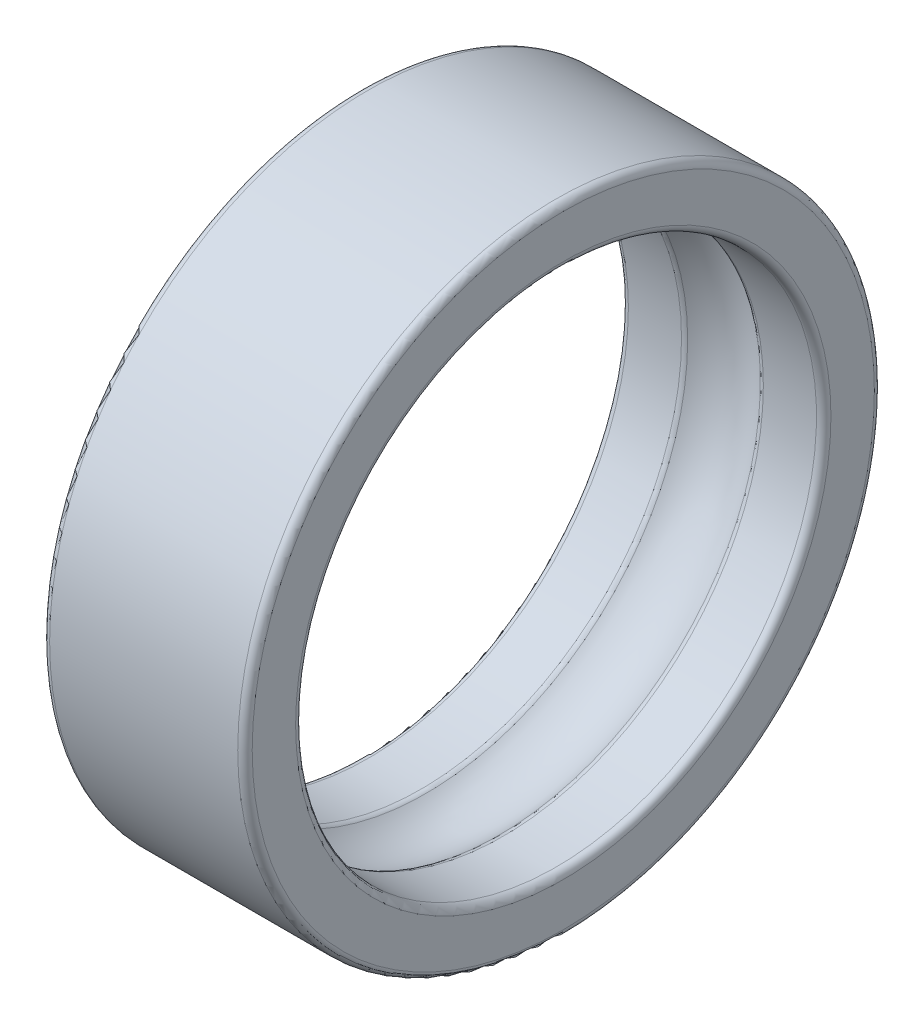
ISO-10303-21;
HEADER;
FILE_DESCRIPTION(('STEP AP214'),'2;1');
FILE_NAME('part.step','',(''),(''),'','','');
FILE_SCHEMA(('AUTOMOTIVE_DESIGN { 1 0 10303 214 1 1 1 1 }'));
ENDSEC;
DATA;
#1=APPLICATION_CONTEXT('core data for automotive mechanical design processes');
#2=APPLICATION_PROTOCOL_DEFINITION('international standard','automotive_design',2000,#1);
#3=PRODUCT_CONTEXT('',#1,'mechanical');
#4=PRODUCT('Part','Part','',(#3));
#5=PRODUCT_RELATED_PRODUCT_CATEGORY('part','',(#4));
#6=PRODUCT_DEFINITION_FORMATION('','',#4);
#7=PRODUCT_DEFINITION_CONTEXT('part definition',#1,'design');
#8=PRODUCT_DEFINITION('design','',#6,#7);
#9=PRODUCT_DEFINITION_SHAPE('','',#8);
#10=(LENGTH_UNIT() NAMED_UNIT(*) SI_UNIT(.MILLI.,.METRE.));
#11=(NAMED_UNIT(*) PLANE_ANGLE_UNIT() SI_UNIT($,.RADIAN.));
#12=(NAMED_UNIT(*) SI_UNIT($,.STERADIAN.) SOLID_ANGLE_UNIT());
#13=UNCERTAINTY_MEASURE_WITH_UNIT(LENGTH_MEASURE(1.E-05),#10,'distance_accuracy_value','');
#14=(GEOMETRIC_REPRESENTATION_CONTEXT(3) GLOBAL_UNCERTAINTY_ASSIGNED_CONTEXT((#13)) GLOBAL_UNIT_ASSIGNED_CONTEXT((#10,
#11,#12)) REPRESENTATION_CONTEXT('',''));
#15=CARTESIAN_POINT('',(0.,0.,0.));
#16=DIRECTION('',(0.,0.,1.));
#17=DIRECTION('',(1.,0.,0.));
#18=AXIS2_PLACEMENT_3D('',#15,#16,#17);
#19=CARTESIAN_POINT('',(-3.5,9.,0.));
#20=DIRECTION('',(1.,0.,0.));
#21=DIRECTION('',(0.,0.,-1.));
#22=AXIS2_PLACEMENT_3D('',#19,#20,#21);
#23=PLANE('',#22);
#24=CARTESIAN_POINT('',(-3.5,0.,0.));
#25=DIRECTION('',(1.,0.,0.));
#26=DIRECTION('',(0.,0.,-1.));
#27=AXIS2_PLACEMENT_3D('',#24,#25,#26);
#28=CIRCLE('',#27,10.75);
#29=CARTESIAN_POINT('',(-3.5,0.,-10.75));
#30=VERTEX_POINT('',#29);
#31=EDGE_CURVE('E56',#30,#30,#28,.F.);
#32=ORIENTED_EDGE('',*,*,#31,.T.);
#33=EDGE_LOOP('',(#32));
#34=FACE_BOUND('',#33,.T.);
#35=CARTESIAN_POINT('',(-3.5,0.,0.));
#36=DIRECTION('',(1.,0.,0.));
#37=DIRECTION('',(0.,0.,-1.));
#38=AXIS2_PLACEMENT_3D('',#35,#36,#37);
#39=CIRCLE('',#38,9.25);
#40=CARTESIAN_POINT('',(-3.5,0.,-9.25));
#41=VERTEX_POINT('',#40);
#42=EDGE_CURVE('E59',#41,#41,#39,.T.);
#43=ORIENTED_EDGE('',*,*,#42,.T.);
#44=EDGE_LOOP('',(#43));
#45=FACE_BOUND('',#44,.T.);
#46=ADVANCED_FACE('F31',(#34,#45),#23,.F.);
#47=CARTESIAN_POINT('',(-31.6676661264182,0.,0.));
#48=DIRECTION('',(-1.,0.,0.));
#49=DIRECTION('',(0.,0.,1.));
#50=AXIS2_PLACEMENT_3D('',#47,#48,#49);
#51=CYLINDRICAL_SURFACE('',#50,9.);
#52=CARTESIAN_POINT('',(-3.25,0.,0.));
#53=DIRECTION('',(1.,0.,0.));
#54=DIRECTION('',(0.,0.,-1.));
#55=AXIS2_PLACEMENT_3D('',#52,#53,#54);
#56=CIRCLE('',#55,9.);
#57=CARTESIAN_POINT('',(-3.25,0.,-9.));
#58=VERTEX_POINT('',#57);
#59=EDGE_CURVE('E50',#58,#58,#56,.F.);
#60=ORIENTED_EDGE('',*,*,#59,.T.);
#61=EDGE_LOOP('',(#60));
#62=FACE_BOUND('',#61,.T.);
#63=CARTESIAN_POINT('',(-1.4142135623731,0.,0.));
#64=DIRECTION('',(1.,0.,0.));
#65=DIRECTION('',(0.,0.,-1.));
#66=AXIS2_PLACEMENT_3D('',#63,#64,#65);
#67=CIRCLE('',#66,9.);
#68=CARTESIAN_POINT('',(-1.4142135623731,0.,-9.));
#69=VERTEX_POINT('',#68);
#70=EDGE_CURVE('E53',#69,#69,#67,.T.);
#71=ORIENTED_EDGE('',*,*,#70,.T.);
#72=EDGE_LOOP('',(#71));
#73=FACE_BOUND('',#72,.T.);
#74=ADVANCED_FACE('F87',(#62,#73),#51,.F.);
#75=CARTESIAN_POINT('',(0.,0.,0.));
#76=DIRECTION('',(-1.,0.,0.));
#77=DIRECTION('',(0.,0.,1.));
#78=AXIS2_PLACEMENT_3D('',#75,#76,#77);
#79=TOROIDAL_SURFACE('',#78,7.5,2.);
#80=CARTESIAN_POINT('',(-1.25707872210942,0.,0.));
#81=DIRECTION('',(1.,0.,0.));
#82=DIRECTION('',(0.,0.,-1.));
#83=AXIS2_PLACEMENT_3D('',#80,#81,#82);
#84=CIRCLE('',#83,9.05555555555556);
#85=CARTESIAN_POINT('',(-1.25707872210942,0.,-9.05555555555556));
#86=VERTEX_POINT('',#85);
#87=EDGE_CURVE('E41',#86,#86,#84,.F.);
#88=ORIENTED_EDGE('',*,*,#87,.T.);
#89=EDGE_LOOP('',(#88));
#90=FACE_BOUND('',#89,.T.);
#91=CARTESIAN_POINT('',(1.25707872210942,0.,0.));
#92=DIRECTION('',(-1.,0.,0.));
#93=DIRECTION('',(0.,0.,1.));
#94=AXIS2_PLACEMENT_3D('',#91,#92,#93);
#95=CIRCLE('',#94,9.05555555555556);
#96=CARTESIAN_POINT('',(1.25707872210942,0.,9.05555555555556));
#97=VERTEX_POINT('',#96);
#98=EDGE_CURVE('E45',#97,#97,#95,.F.);
#99=ORIENTED_EDGE('',*,*,#98,.T.);
#100=EDGE_LOOP('',(#99));
#101=FACE_BOUND('',#100,.T.);
#102=ADVANCED_FACE('F98',(#90,#101),#79,.F.);
#103=CARTESIAN_POINT('',(-31.6676661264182,0.,0.));
#104=DIRECTION('',(-1.,0.,0.));
#105=DIRECTION('',(0.,0.,1.));
#106=AXIS2_PLACEMENT_3D('',#103,#104,#105);
#107=CYLINDRICAL_SURFACE('',#106,9.);
#108=CARTESIAN_POINT('',(1.4142135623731,0.,0.));
#109=DIRECTION('',(1.,0.,0.));
#110=DIRECTION('',(0.,0.,-1.));
#111=AXIS2_PLACEMENT_3D('',#108,#109,#110);
#112=CIRCLE('',#111,9.);
#113=CARTESIAN_POINT('',(1.4142135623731,0.,-9.));
#114=VERTEX_POINT('',#113);
#115=EDGE_CURVE('E10',#114,#114,#112,.F.);
#116=ORIENTED_EDGE('',*,*,#115,.T.);
#117=EDGE_LOOP('',(#116));
#118=FACE_BOUND('',#117,.T.);
#119=CARTESIAN_POINT('',(3.25,0.,0.));
#120=DIRECTION('',(-1.,0.,0.));
#121=DIRECTION('',(0.,0.,1.));
#122=AXIS2_PLACEMENT_3D('',#119,#120,#121);
#123=CIRCLE('',#122,9.);
#124=CARTESIAN_POINT('',(3.25,0.,9.));
#125=VERTEX_POINT('',#124);
#126=EDGE_CURVE('E37',#125,#125,#123,.F.);
#127=ORIENTED_EDGE('',*,*,#126,.T.);
#128=EDGE_LOOP('',(#127));
#129=FACE_BOUND('',#128,.T.);
#130=ADVANCED_FACE('F109',(#118,#129),#107,.F.);
#131=CARTESIAN_POINT('',(3.5,9.,0.));
#132=DIRECTION('',(-1.,0.,0.));
#133=DIRECTION('',(0.,0.,1.));
#134=AXIS2_PLACEMENT_3D('',#131,#132,#133);
#135=PLANE('',#134);
#136=CARTESIAN_POINT('',(3.5,0.,0.));
#137=DIRECTION('',(-1.,0.,0.));
#138=DIRECTION('',(0.,0.,1.));
#139=AXIS2_PLACEMENT_3D('',#136,#137,#138);
#140=CIRCLE('',#139,10.75);
#141=CARTESIAN_POINT('',(3.5,0.,10.75));
#142=VERTEX_POINT('',#141);
#143=EDGE_CURVE('E62',#142,#142,#140,.F.);
#144=ORIENTED_EDGE('',*,*,#143,.T.);
#145=EDGE_LOOP('',(#144));
#146=FACE_BOUND('',#145,.T.);
#147=CARTESIAN_POINT('',(3.5,0.,0.));
#148=DIRECTION('',(-1.,0.,0.));
#149=DIRECTION('',(0.,0.,1.));
#150=AXIS2_PLACEMENT_3D('',#147,#148,#149);
#151=CIRCLE('',#150,9.25);
#152=CARTESIAN_POINT('',(3.5,0.,9.25));
#153=VERTEX_POINT('',#152);
#154=EDGE_CURVE('E65',#153,#153,#151,.T.);
#155=ORIENTED_EDGE('',*,*,#154,.T.);
#156=EDGE_LOOP('',(#155));
#157=FACE_BOUND('',#156,.T.);
#158=ADVANCED_FACE('F128',(#146,#157),#135,.F.);
#159=CARTESIAN_POINT('',(-31.6676661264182,0.,0.));
#160=DIRECTION('',(-1.,0.,0.));
#161=DIRECTION('',(0.,0.,1.));
#162=AXIS2_PLACEMENT_3D('',#159,#160,#161);
#163=CYLINDRICAL_SURFACE('',#162,11.);
#164=CARTESIAN_POINT('',(3.25,0.,0.));
#165=DIRECTION('',(-1.,0.,0.));
#166=DIRECTION('',(0.,0.,1.));
#167=AXIS2_PLACEMENT_3D('',#164,#165,#166);
#168=CIRCLE('',#167,11.);
#169=CARTESIAN_POINT('',(3.25,0.,11.));
#170=VERTEX_POINT('',#169);
#171=EDGE_CURVE('E68',#170,#170,#168,.T.);
#172=ORIENTED_EDGE('',*,*,#171,.T.);
#173=EDGE_LOOP('',(#172));
#174=FACE_BOUND('',#173,.T.);
#175=CARTESIAN_POINT('',(-3.25,0.,0.));
#176=DIRECTION('',(1.,0.,0.));
#177=DIRECTION('',(0.,0.,-1.));
#178=AXIS2_PLACEMENT_3D('',#175,#176,#177);
#179=CIRCLE('',#178,11.);
#180=CARTESIAN_POINT('',(-3.25,0.,-11.));
#181=VERTEX_POINT('',#180);
#182=EDGE_CURVE('E71',#181,#181,#179,.T.);
#183=ORIENTED_EDGE('',*,*,#182,.T.);
#184=EDGE_LOOP('',(#183));
#185=FACE_BOUND('',#184,.T.);
#186=ADVANCED_FACE('F75',(#174,#185),#163,.T.);
#187=CARTESIAN_POINT('',(3.25,0.,0.));
#188=DIRECTION('',(-1.,0.,0.));
#189=DIRECTION('',(0.,0.,1.));
#190=AXIS2_PLACEMENT_3D('',#187,#188,#189);
#191=TOROIDAL_SURFACE('',#190,10.75,0.25);
#192=ORIENTED_EDGE('',*,*,#143,.F.);
#193=EDGE_LOOP('',(#192));
#194=FACE_BOUND('',#193,.T.);
#195=ORIENTED_EDGE('',*,*,#171,.F.);
#196=EDGE_LOOP('',(#195));
#197=FACE_BOUND('',#196,.T.);
#198=ADVANCED_FACE('F81',(#194,#197),#191,.T.);
#199=CARTESIAN_POINT('',(-3.25,0.,0.));
#200=DIRECTION('',(1.,0.,0.));
#201=DIRECTION('',(0.,0.,-1.));
#202=AXIS2_PLACEMENT_3D('',#199,#200,#201);
#203=TOROIDAL_SURFACE('',#202,10.75,0.25);
#204=ORIENTED_EDGE('',*,*,#182,.F.);
#205=EDGE_LOOP('',(#204));
#206=FACE_BOUND('',#205,.T.);
#207=ORIENTED_EDGE('',*,*,#31,.F.);
#208=EDGE_LOOP('',(#207));
#209=FACE_BOUND('',#208,.T.);
#210=ADVANCED_FACE('F77',(#206,#209),#203,.T.);
#211=CARTESIAN_POINT('',(-3.25,0.,0.));
#212=DIRECTION('',(1.,0.,0.));
#213=DIRECTION('',(0.,0.,-1.));
#214=AXIS2_PLACEMENT_3D('',#211,#212,#213);
#215=TOROIDAL_SURFACE('',#214,9.25,0.25);
#216=ORIENTED_EDGE('',*,*,#42,.F.);
#217=EDGE_LOOP('',(#216));
#218=FACE_BOUND('',#217,.T.);
#219=ORIENTED_EDGE('',*,*,#59,.F.);
#220=EDGE_LOOP('',(#219));
#221=FACE_BOUND('',#220,.T.);
#222=ADVANCED_FACE('F80',(#218,#221),#215,.T.);
#223=CARTESIAN_POINT('',(-1.4142135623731,0.,0.));
#224=DIRECTION('',(1.,0.,0.));
#225=DIRECTION('',(0.,0.,-1.));
#226=AXIS2_PLACEMENT_3D('',#223,#224,#225);
#227=TOROIDAL_SURFACE('',#226,9.25,0.25);
#228=ORIENTED_EDGE('',*,*,#70,.F.);
#229=EDGE_LOOP('',(#228));
#230=FACE_BOUND('',#229,.T.);
#231=ORIENTED_EDGE('',*,*,#87,.F.);
#232=EDGE_LOOP('',(#231));
#233=FACE_BOUND('',#232,.T.);
#234=ADVANCED_FACE('F92',(#230,#233),#227,.T.);
#235=CARTESIAN_POINT('',(1.4142135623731,0.,0.));
#236=DIRECTION('',(1.,0.,0.));
#237=DIRECTION('',(0.,0.,-1.));
#238=AXIS2_PLACEMENT_3D('',#235,#236,#237);
#239=TOROIDAL_SURFACE('',#238,9.25,0.25);
#240=ORIENTED_EDGE('',*,*,#98,.F.);
#241=EDGE_LOOP('',(#240));
#242=FACE_BOUND('',#241,.T.);
#243=ORIENTED_EDGE('',*,*,#115,.F.);
#244=EDGE_LOOP('',(#243));
#245=FACE_BOUND('',#244,.T.);
#246=ADVANCED_FACE('F103',(#242,#245),#239,.T.);
#247=CARTESIAN_POINT('',(3.25,0.,0.));
#248=DIRECTION('',(-1.,0.,0.));
#249=DIRECTION('',(0.,0.,1.));
#250=AXIS2_PLACEMENT_3D('',#247,#248,#249);
#251=TOROIDAL_SURFACE('',#250,9.25,0.25);
#252=ORIENTED_EDGE('',*,*,#126,.F.);
#253=EDGE_LOOP('',(#252));
#254=FACE_BOUND('',#253,.T.);
#255=ORIENTED_EDGE('',*,*,#154,.F.);
#256=EDGE_LOOP('',(#255));
#257=FACE_BOUND('',#256,.T.);
#258=ADVANCED_FACE('F115',(#254,#257),#251,.T.);
#259=CLOSED_SHELL('',(#46,#74,#102,#130,#158,#186,#198,#210,#222,#234,#246,#258));
#260=MANIFOLD_SOLID_BREP('B2',#259);
#261=ADVANCED_BREP_SHAPE_REPRESENTATION('',(#18,#260),#14);
#262=SHAPE_DEFINITION_REPRESENTATION(#9,#261);
ENDSEC;
END-ISO-10303-21;
